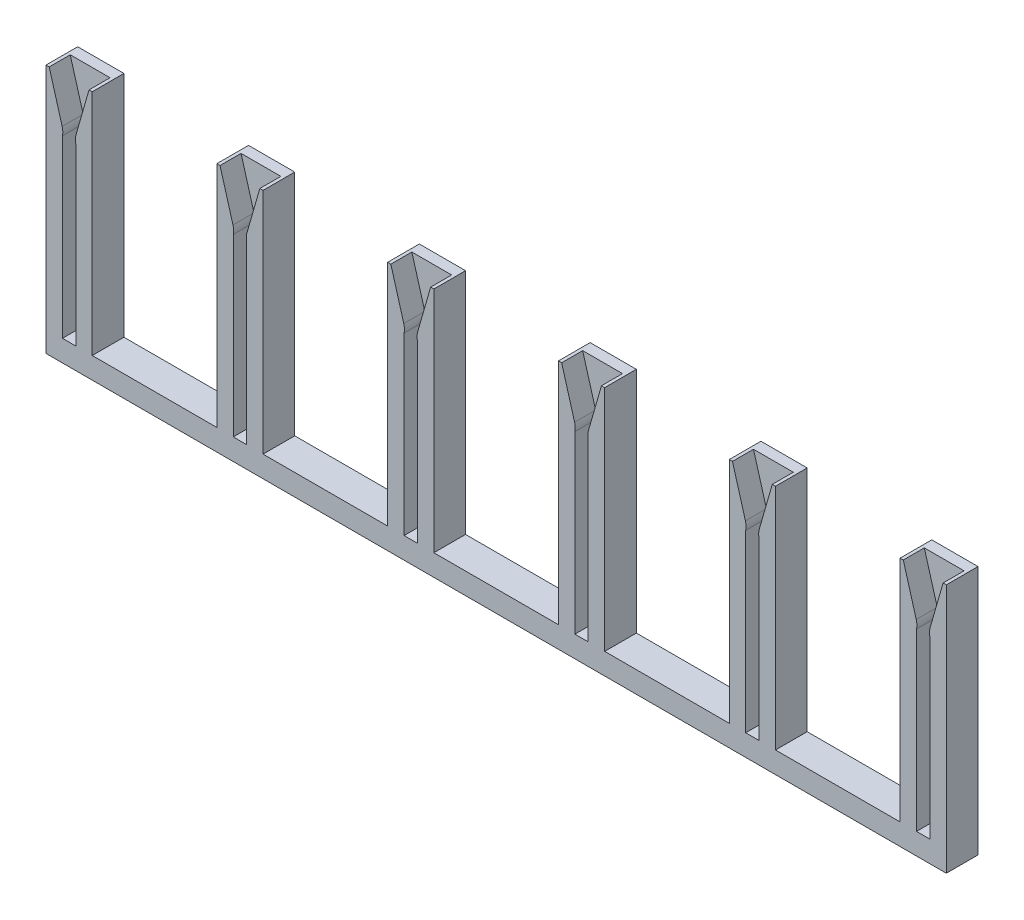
from build123d import *

# Parameters (mm, degrees)
BOSS_EXTRUDE2_DEPTH     = 2.500122
BOSS_EXTRUDE3_DEPTH     = 1.27
LPATTERN1_COUNT         = 6
LPATTERN1_PITCH         = 20.32
CUT_EXTRUDE1_DEPTH      = 123.287441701
CUT_EXTRUDE1_DEPTH_BACK = 123.287441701
SKETCH2_W               = 14.82
SKETCH2_H               = 2.54


with BuildPart() as part:
    # Sketch1 → Boss-Extrude2 (new body)
    with BuildSketch(Plane(origin=(0, 0, 0), x_dir=(-1, 0, 0), z_dir=(0, 0, -1))):
        with BuildLine():
            Line((-2.75, 0), (-2.75, -2.54))
            Line((-2.75, -2.54), (17.57, -2.54))
            Line((17.57, -2.54), (17.57, 0))
            Line((17.57, 0), (2.75, 0))
            Line((2.75, 0), (2.75, 27.175644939))
            Line((2.75, 27.175644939), (2.369, 27.175644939))
            Line((2.369, 27.175644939), (0.827956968, 21.81898316))
            ThreePointArc((0.827956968, 21.81898316), (0.751245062, 21.336595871), (0.79375, 20.849999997))
            Line((0.79375, 20.849999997), (0.793750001, 0))
            Line((0.793750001, 0), (-0.793750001, 0))
            Line((-0.793750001, 0), (-0.79375, 20.849999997))
            ThreePointArc((-0.79375, 20.849999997), (-0.751245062, 21.336595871), (-0.827956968, 21.81898316))
            Line((-0.827956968, 21.81898316), (-2.369, 27.175644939))
            Line((-2.369, 27.175644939), (-2.75, 27.175644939))
            Line((-2.75, 27.175644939), (-2.75, 0))
        make_face()
    boss_extrude2 = extrude(amount=BOSS_EXTRUDE2_DEPTH)

    # Sketch4 → Boss-Extrude3 (add)
    with BuildSketch(Plane(origin=(0, 0, -2.500122), x_dir=(-1, 0, 0), z_dir=(0, 0, -1))):
        Polygon((-2.75, 27.175644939), (2.75, 27.175644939), (2.75, 0), (17.57, 0), (17.57, -2.54), (-2.75, -2.54), align=None)
    boss_extrude3 = extrude(amount=BOSS_EXTRUDE3_DEPTH)

    # LPattern1: Boss-Extrude2, Boss-Extrude3 ×6
    with Locations(*[(-i * LPATTERN1_PITCH, 0, 0) for i in range(1, LPATTERN1_COUNT)]):
        add(boss_extrude2)
        add(boss_extrude3)

    # Sketch2 → Cut-Extrude1 (cut, two sides: drawn at the far end of the back side and taken through both)
    with BuildSketch(Plane(origin=(0, 0, -3.770122), x_dir=(-1, 0, 0), z_dir=(0, 0, -1)).offset(-CUT_EXTRUDE1_DEPTH_BACK)):
        with Locations((111.76, -1.27)):
            Rectangle(SKETCH2_W, SKETCH2_H)
    extrude(amount=CUT_EXTRUDE1_DEPTH + CUT_EXTRUDE1_DEPTH_BACK, mode=Mode.SUBTRACT)


solid = part.part
